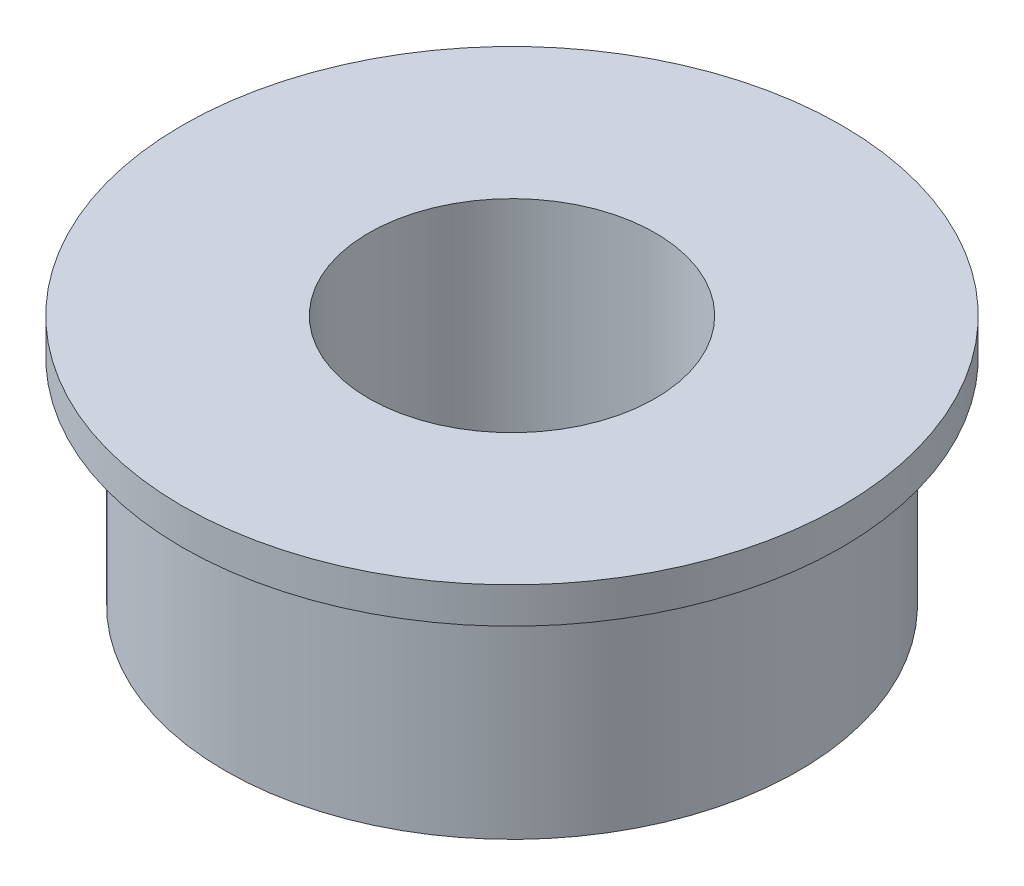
from build123d import *

# Parameters (mm, degrees)
SKETCH_1_R      = 4
SKETCH_1_R_2    = 2
EXTRUDE_1_DEPTH = 3
SKETCH_2_R      = 4.6
SKETCH_2_R_2    = 2
EXTRUDE_2_DEPTH = 0.5


with BuildPart() as part:
    # Sketch 1 → Extrude 1 (new body)
    with BuildSketch(Plane(origin=(0, 0, 0), x_dir=(1, 0, 0), z_dir=(0, 1, 0))):
        with Locations(Location((0, 0, 0), (0, 0, 270))):
            Circle(SKETCH_1_R)
        with Locations(Location((0, 0, 0), (0, 0, 270))):
            Circle(SKETCH_1_R_2, mode=Mode.SUBTRACT)
    extrude(amount=EXTRUDE_1_DEPTH)

    # Sketch 2 → Extrude 2 (add)
    with BuildSketch(Plane(origin=(0, 3, 0), x_dir=(1, 0, 0), z_dir=(0, 1, 0))):
        with Locations(Location((0, 0, 0), (0, 0, 270))):
            Circle(SKETCH_2_R)
        with Locations(Location((0, 0, 0), (0, 0, 270))):
            Circle(SKETCH_2_R_2, mode=Mode.SUBTRACT)
    extrude(amount=EXTRUDE_2_DEPTH)


solid = part.part
